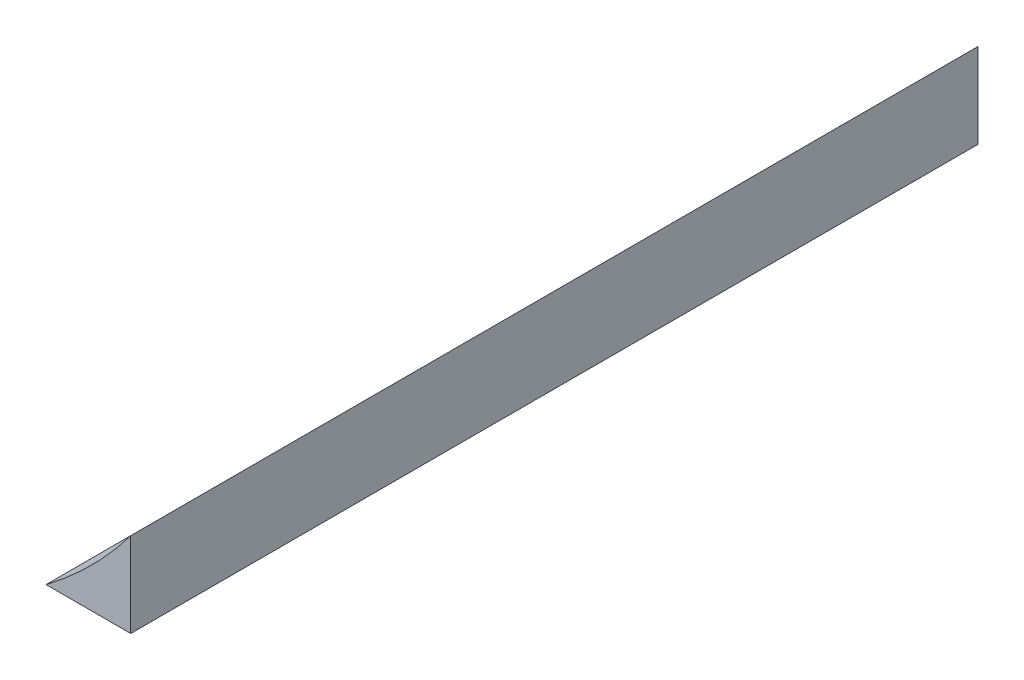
ISO-10303-21;
HEADER;
FILE_DESCRIPTION(('STEP AP214'),'2;1');
FILE_NAME('part.step','',(''),(''),'','','');
FILE_SCHEMA(('AUTOMOTIVE_DESIGN { 1 0 10303 214 1 1 1 1 }'));
ENDSEC;
DATA;
#1=APPLICATION_CONTEXT('core data for automotive mechanical design processes');
#2=APPLICATION_PROTOCOL_DEFINITION('international standard','automotive_design',2000,#1);
#3=PRODUCT_CONTEXT('',#1,'mechanical');
#4=PRODUCT('Part','Part','',(#3));
#5=PRODUCT_RELATED_PRODUCT_CATEGORY('part','',(#4));
#6=PRODUCT_DEFINITION_FORMATION('','',#4);
#7=PRODUCT_DEFINITION_CONTEXT('part definition',#1,'design');
#8=PRODUCT_DEFINITION('design','',#6,#7);
#9=PRODUCT_DEFINITION_SHAPE('','',#8);
#10=(LENGTH_UNIT() NAMED_UNIT(*) SI_UNIT(.MILLI.,.METRE.));
#11=(NAMED_UNIT(*) PLANE_ANGLE_UNIT() SI_UNIT($,.RADIAN.));
#12=(NAMED_UNIT(*) SI_UNIT($,.STERADIAN.) SOLID_ANGLE_UNIT());
#13=UNCERTAINTY_MEASURE_WITH_UNIT(LENGTH_MEASURE(1.E-05),#10,'distance_accuracy_value','');
#14=(GEOMETRIC_REPRESENTATION_CONTEXT(3) GLOBAL_UNCERTAINTY_ASSIGNED_CONTEXT((#13)) GLOBAL_UNIT_ASSIGNED_CONTEXT((#10,
#11,#12)) REPRESENTATION_CONTEXT('',''));
#15=CARTESIAN_POINT('',(0.,0.,0.));
#16=DIRECTION('',(0.,0.,1.));
#17=DIRECTION('',(1.,0.,0.));
#18=AXIS2_PLACEMENT_3D('',#15,#16,#17);
#19=CARTESIAN_POINT('',(65.,50.0000000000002,9.99999999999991));
#20=DIRECTION('',(0.,-1.,0.));
#21=DIRECTION('',(-1.,0.,0.));
#22=AXIS2_PLACEMENT_3D('',#19,#20,#21);
#23=PLANE('',#22);
#24=DIRECTION('',(1.,0.,0.));
#25=VECTOR('',#24,1.);
#26=CARTESIAN_POINT('',(65.,50.0000000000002,9.99999999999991));
#27=LINE('',#26,#25);
#28=CARTESIAN_POINT('',(109.999999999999,50.0000000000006,9.99999999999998));
#29=VERTEX_POINT('',#28);
#30=CARTESIAN_POINT('',(115.,50.0000000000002,9.99999999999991));
#31=VERTEX_POINT('',#30);
#32=EDGE_CURVE('E100',#29,#31,#27,.T.);
#33=ORIENTED_EDGE('',*,*,#32,.T.);
#34=DIRECTION('',(0.,0.,1.));
#35=VECTOR('',#34,1.);
#36=CARTESIAN_POINT('',(115.,50.0000000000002,9.99999999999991));
#37=LINE('',#36,#35);
#38=CARTESIAN_POINT('',(115.,50.0000000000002,59.9999999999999));
#39=VERTEX_POINT('',#38);
#40=EDGE_CURVE('E80',#31,#39,#37,.T.);
#41=ORIENTED_EDGE('',*,*,#40,.T.);
#42=DIRECTION('',(1.,0.,0.));
#43=VECTOR('',#42,1.);
#44=CARTESIAN_POINT('',(65.,50.0000000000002,59.9999999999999));
#45=LINE('',#44,#43);
#46=CARTESIAN_POINT('',(110.,50.0000000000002,60.));
#47=VERTEX_POINT('',#46);
#48=EDGE_CURVE('E83',#47,#39,#45,.T.);
#49=ORIENTED_EDGE('',*,*,#48,.F.);
#50=DIRECTION('',(0.,0.,-1.));
#51=VECTOR('',#50,1.);
#52=CARTESIAN_POINT('',(110.,50.0000000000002,59.9999999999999));
#53=LINE('',#52,#51);
#54=EDGE_CURVE('E54',#29,#47,#53,.F.);
#55=ORIENTED_EDGE('',*,*,#54,.F.);
#56=EDGE_LOOP('',(#33,#41,#49,#55));
#57=FACE_BOUND('',#56,.T.);
#58=ADVANCED_FACE('F50',(#57),#23,.T.);
#59=CARTESIAN_POINT('',(94.9107188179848,70.0892811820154,9.99999999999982));
#60=DIRECTION('',(0.,0.,1.));
#61=DIRECTION('',(1.,0.,0.));
#62=AXIS2_PLACEMENT_3D('',#59,#60,#61);
#63=PLANE('',#62);
#64=DIRECTION('',(0.,-1.,0.));
#65=VECTOR('',#64,1.);
#66=CARTESIAN_POINT('',(115.,50.0000000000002,9.99999999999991));
#67=LINE('',#66,#65);
#68=CARTESIAN_POINT('',(115.,55.0000000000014,10.));
#69=VERTEX_POINT('',#68);
#70=EDGE_CURVE('E99',#69,#31,#67,.T.);
#71=ORIENTED_EDGE('',*,*,#70,.T.);
#72=ORIENTED_EDGE('',*,*,#32,.F.);
#73=CARTESIAN_POINT('',(94.9107188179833,70.0892811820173,10.0000000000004));
#74=DIRECTION('',(0.,0.,-1.));
#75=DIRECTION('',(0.,1.,0.));
#76=AXIS2_PLACEMENT_3D('',#73,#74,#75);
#77=CIRCLE('',#76,25.1250000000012);
#78=EDGE_CURVE('E93',#69,#29,#77,.T.);
#79=ORIENTED_EDGE('',*,*,#78,.F.);
#80=EDGE_LOOP('',(#71,#72,#79));
#81=FACE_BOUND('',#80,.T.);
#82=ADVANCED_FACE('F116',(#81),#63,.F.);
#83=CARTESIAN_POINT('',(115.,75.9999999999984,230.000000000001));
#84=DIRECTION('',(1.,0.,0.));
#85=DIRECTION('',(0.,1.,0.));
#86=AXIS2_PLACEMENT_3D('',#83,#84,#85);
#87=PLANE('',#86);
#88=DIRECTION('',(0.,0.,-1.));
#89=VECTOR('',#88,1.);
#90=CARTESIAN_POINT('',(115.,55.0000000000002,59.9999999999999));
#91=LINE('',#90,#89);
#92=CARTESIAN_POINT('',(115.,55.0000000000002,60.));
#93=VERTEX_POINT('',#92);
#94=EDGE_CURVE('E60',#93,#69,#91,.T.);
#95=ORIENTED_EDGE('',*,*,#94,.F.);
#96=DIRECTION('',(0.,-1.,0.));
#97=VECTOR('',#96,1.);
#98=CARTESIAN_POINT('',(115.,50.0000000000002,59.9999999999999));
#99=LINE('',#98,#97);
#100=EDGE_CURVE('E87',#93,#39,#99,.T.);
#101=ORIENTED_EDGE('',*,*,#100,.T.);
#102=ORIENTED_EDGE('',*,*,#40,.F.);
#103=ORIENTED_EDGE('',*,*,#70,.F.);
#104=EDGE_LOOP('',(#95,#101,#102,#103));
#105=FACE_BOUND('',#104,.T.);
#106=ADVANCED_FACE('F113',(#105),#87,.T.);
#107=CARTESIAN_POINT('',(94.9107188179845,70.0892811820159,59.9999999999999));
#108=DIRECTION('',(0.,0.,1.));
#109=DIRECTION('',(0.,-1.,0.));
#110=AXIS2_PLACEMENT_3D('',#107,#108,#109);
#111=PLANE('',#110);
#112=ORIENTED_EDGE('',*,*,#100,.F.);
#113=CARTESIAN_POINT('',(94.9107188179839,70.0892811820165,60.0000000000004));
#114=DIRECTION('',(0.,0.,-1.));
#115=DIRECTION('',(0.,1.,0.));
#116=AXIS2_PLACEMENT_3D('',#113,#114,#115);
#117=CIRCLE('',#116,25.1250000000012);
#118=EDGE_CURVE('E12',#47,#93,#117,.F.);
#119=ORIENTED_EDGE('',*,*,#118,.F.);
#120=ORIENTED_EDGE('',*,*,#48,.T.);
#121=EDGE_LOOP('',(#112,#119,#120));
#122=FACE_BOUND('',#121,.T.);
#123=ADVANCED_FACE('F89',(#122),#111,.T.);
#124=CARTESIAN_POINT('',(94.9107188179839,70.0892811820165,60.0000000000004));
#125=DIRECTION('',(0.,0.,-1.));
#126=DIRECTION('',(0.,1.,0.));
#127=AXIS2_PLACEMENT_3D('',#124,#125,#126);
#128=CYLINDRICAL_SURFACE('',#127,25.1250000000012);
#129=ORIENTED_EDGE('',*,*,#118,.T.);
#130=ORIENTED_EDGE('',*,*,#94,.T.);
#131=ORIENTED_EDGE('',*,*,#78,.T.);
#132=ORIENTED_EDGE('',*,*,#54,.T.);
#133=EDGE_LOOP('',(#129,#130,#131,#132));
#134=FACE_BOUND('',#133,.T.);
#135=ADVANCED_FACE('F52',(#134),#128,.F.);
#136=CLOSED_SHELL('',(#58,#82,#106,#123,#135));
#137=MANIFOLD_SOLID_BREP('B2',#136);
#138=ADVANCED_BREP_SHAPE_REPRESENTATION('',(#18,#137),#14);
#139=SHAPE_DEFINITION_REPRESENTATION(#9,#138);
ENDSEC;
END-ISO-10303-21;
